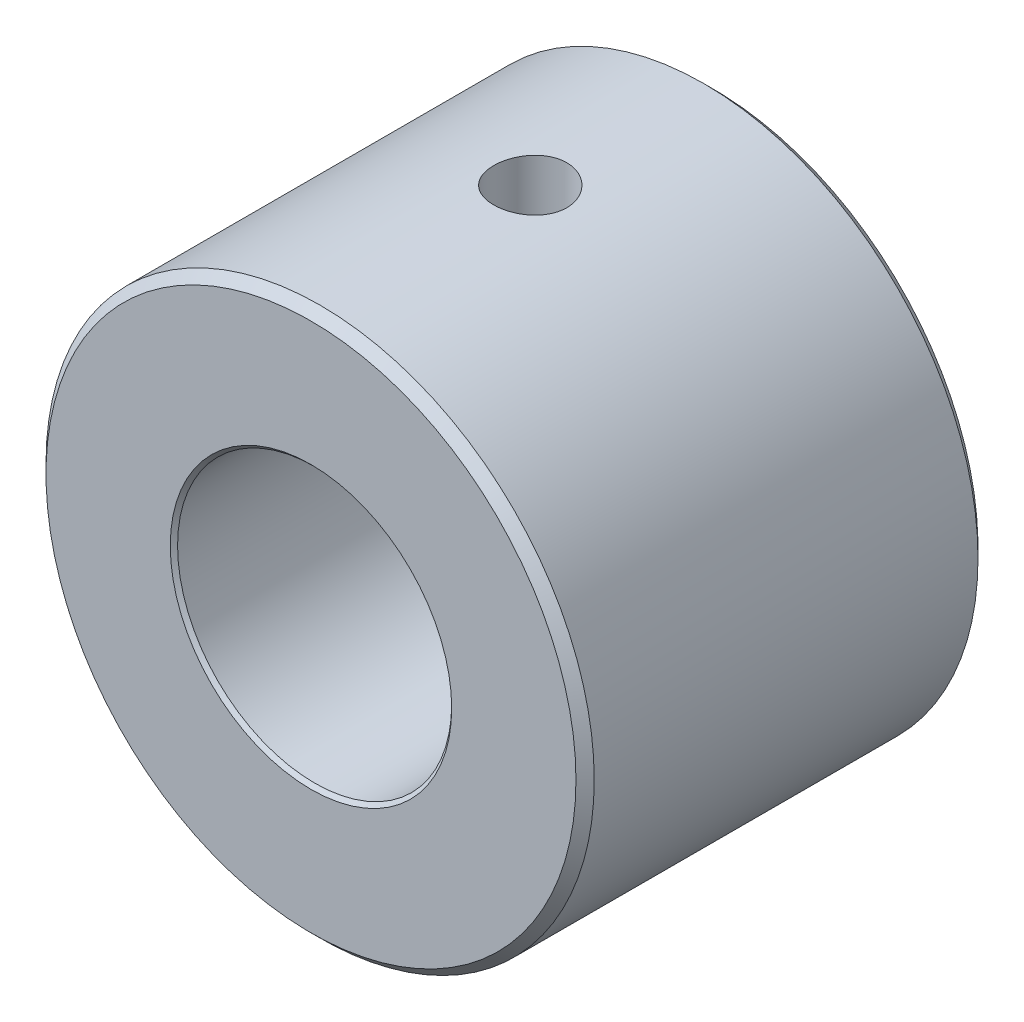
ISO-10303-21;
HEADER;
FILE_DESCRIPTION(('STEP AP214'),'2;1');
FILE_NAME('part.step','',(''),(''),'','','');
FILE_SCHEMA(('AUTOMOTIVE_DESIGN { 1 0 10303 214 1 1 1 1 }'));
ENDSEC;
DATA;
#1=APPLICATION_CONTEXT('core data for automotive mechanical design processes');
#2=APPLICATION_PROTOCOL_DEFINITION('international standard','automotive_design',2000,#1);
#3=PRODUCT_CONTEXT('',#1,'mechanical');
#4=PRODUCT('Part','Part','',(#3));
#5=PRODUCT_RELATED_PRODUCT_CATEGORY('part','',(#4));
#6=PRODUCT_DEFINITION_FORMATION('','',#4);
#7=PRODUCT_DEFINITION_CONTEXT('part definition',#1,'design');
#8=PRODUCT_DEFINITION('design','',#6,#7);
#9=PRODUCT_DEFINITION_SHAPE('','',#8);
#10=(LENGTH_UNIT() NAMED_UNIT(*) SI_UNIT(.MILLI.,.METRE.));
#11=(NAMED_UNIT(*) PLANE_ANGLE_UNIT() SI_UNIT($,.RADIAN.));
#12=(NAMED_UNIT(*) SI_UNIT($,.STERADIAN.) SOLID_ANGLE_UNIT());
#13=UNCERTAINTY_MEASURE_WITH_UNIT(LENGTH_MEASURE(1.E-05),#10,'distance_accuracy_value','');
#14=(GEOMETRIC_REPRESENTATION_CONTEXT(3) GLOBAL_UNCERTAINTY_ASSIGNED_CONTEXT((#13)) GLOBAL_UNIT_ASSIGNED_CONTEXT((#10,
#11,#12)) REPRESENTATION_CONTEXT('',''));
#15=CARTESIAN_POINT('',(0.,0.,0.));
#16=DIRECTION('',(0.,0.,1.));
#17=DIRECTION('',(1.,0.,0.));
#18=AXIS2_PLACEMENT_3D('',#15,#16,#17);
#19=CARTESIAN_POINT('',(0.,0.,0.));
#20=DIRECTION('',(0.,0.,-1.));
#21=DIRECTION('',(-1.,0.,0.));
#22=AXIS2_PLACEMENT_3D('',#19,#20,#21);
#23=CYLINDRICAL_SURFACE('',#22,15.);
#24=CARTESIAN_POINT('',(0.,15.,0.));
#25=CARTESIAN_POINT('',(0.111808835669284,14.9999983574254,-4.70970691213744E-06));
#26=CARTESIAN_POINT('',(0.22368597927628,14.9987367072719,-0.00940753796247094));
#27=CARTESIAN_POINT('',(0.444322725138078,14.993825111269,-0.0467663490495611));
#28=CARTESIAN_POINT('',(0.553079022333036,14.9901727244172,-0.0747412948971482));
#29=CARTESIAN_POINT('',(0.764248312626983,14.9808907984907,-0.148401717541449));
#30=CARTESIAN_POINT('',(0.866665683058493,14.9752626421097,-0.194074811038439));
#31=CARTESIAN_POINT('',(1.0623638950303,14.9626538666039,-0.301806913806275));
#32=CARTESIAN_POINT('',(1.15564620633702,14.9556734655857,-0.363863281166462));
#33=CARTESIAN_POINT('',(1.33102582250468,14.9410899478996,-0.503013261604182));
#34=CARTESIAN_POINT('',(1.41305798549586,14.9334835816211,-0.58018864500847));
#35=CARTESIAN_POINT('',(1.56304735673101,14.9185313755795,-0.747210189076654));
#36=CARTESIAN_POINT('',(1.63100381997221,14.9111855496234,-0.837057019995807));
#37=CARTESIAN_POINT('',(1.75115902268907,14.8975543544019,-1.02729912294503));
#38=CARTESIAN_POINT('',(1.80329607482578,14.8912731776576,-1.12773368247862));
#39=CARTESIAN_POINT('',(1.8899384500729,14.8805258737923,-1.33603106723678));
#40=CARTESIAN_POINT('',(1.92444453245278,14.8760596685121,-1.44389357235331));
#41=CARTESIAN_POINT('',(1.97464606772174,14.8694793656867,-1.66330581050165));
#42=CARTESIAN_POINT('',(1.99045204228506,14.8673514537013,-1.77482983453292));
#43=CARTESIAN_POINT('',(2.00314680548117,14.8656465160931,-1.99896617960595));
#44=CARTESIAN_POINT('',(2.00003645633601,14.866069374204,-2.11157845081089));
#45=CARTESIAN_POINT('',(1.97507745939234,14.8694055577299,-2.33392113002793));
#46=CARTESIAN_POINT('',(1.95335097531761,14.8723026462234,-2.4436655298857));
#47=CARTESIAN_POINT('',(1.89196724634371,14.8802355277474,-2.65793683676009));
#48=CARTESIAN_POINT('',(1.85230959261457,14.8852713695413,-2.76246362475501));
#49=CARTESIAN_POINT('',(1.75605929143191,14.8969326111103,-2.96370963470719));
#50=CARTESIAN_POINT('',(1.69941397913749,14.903562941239,-3.0604033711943));
#51=CARTESIAN_POINT('',(1.57083393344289,14.9176623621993,-3.24295908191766));
#52=CARTESIAN_POINT('',(1.49889840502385,14.9251314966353,-3.32882049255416));
#53=CARTESIAN_POINT('',(1.34110490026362,14.9401389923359,-3.48798301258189));
#54=CARTESIAN_POINT('',(1.25514170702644,14.947677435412,-3.56117984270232));
#55=CARTESIAN_POINT('',(1.07209417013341,14.9619192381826,-3.69212204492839));
#56=CARTESIAN_POINT('',(0.975009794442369,14.9686225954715,-3.74986737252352));
#57=CARTESIAN_POINT('',(0.772392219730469,14.9804439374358,-3.84826911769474));
#58=CARTESIAN_POINT('',(0.66685557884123,14.9855612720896,-3.88891853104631));
#59=CARTESIAN_POINT('',(0.45037092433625,14.9936282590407,-3.95188931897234));
#60=CARTESIAN_POINT('',(0.339423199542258,14.9965780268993,-3.97421167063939));
#61=CARTESIAN_POINT('',(0.116166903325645,14.9999624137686,-3.99975843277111));
#62=CARTESIAN_POINT('',(0.00387503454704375,15.0004159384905,-4.00312640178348));
#63=CARTESIAN_POINT('',(-0.219671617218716,14.9988079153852,-3.99104833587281));
#64=CARTESIAN_POINT('',(-0.330926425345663,14.996746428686,-3.97560275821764));
#65=CARTESIAN_POINT('',(-0.548813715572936,14.990351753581,-3.92645534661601));
#66=CARTESIAN_POINT('',(-0.655462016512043,14.9860271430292,-3.89282243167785));
#67=CARTESIAN_POINT('',(-0.861605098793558,14.9755900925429,-3.80832703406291));
#68=CARTESIAN_POINT('',(-0.961099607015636,14.9694775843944,-3.75746389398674));
#69=CARTESIAN_POINT('',(-1.15074887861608,14.9560983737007,-3.63960784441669));
#70=CARTESIAN_POINT('',(-1.2408458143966,14.9488251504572,-3.57252263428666));
#71=CARTESIAN_POINT('',(-1.40855294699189,14.9339572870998,-3.42425667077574));
#72=CARTESIAN_POINT('',(-1.48616257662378,14.9263626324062,-3.34307527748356));
#73=CARTESIAN_POINT('',(-1.62720549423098,14.9116490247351,-3.16828685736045));
#74=CARTESIAN_POINT('',(-1.69054327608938,14.904533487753,-3.07460243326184));
#75=CARTESIAN_POINT('',(-1.80058351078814,14.8916413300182,-2.87784058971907));
#76=CARTESIAN_POINT('',(-1.84728633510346,14.8858646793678,-2.77476338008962));
#77=CARTESIAN_POINT('',(-1.92257836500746,14.8763281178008,-2.56244275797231));
#78=CARTESIAN_POINT('',(-1.95122028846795,14.872562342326,-2.45321831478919));
#79=CARTESIAN_POINT('',(-1.98974667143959,14.8674574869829,-2.23145636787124));
#80=CARTESIAN_POINT('',(-1.99963213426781,14.8661182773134,-2.11891904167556));
#81=CARTESIAN_POINT('',(-2.00034485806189,14.8660223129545,-1.89467650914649));
#82=CARTESIAN_POINT('',(-1.99132219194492,14.8672452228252,-1.78297175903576));
#83=CARTESIAN_POINT('',(-1.95479376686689,14.872091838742,-1.56268212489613));
#84=CARTESIAN_POINT('',(-1.92728801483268,14.8757155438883,-1.45409723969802));
#85=CARTESIAN_POINT('',(-1.85462310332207,14.8849489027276,-1.24315631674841));
#86=CARTESIAN_POINT('',(-1.80947220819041,14.890557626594,-1.14079738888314));
#87=CARTESIAN_POINT('',(-1.70281342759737,14.9031304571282,-0.945084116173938));
#88=CARTESIAN_POINT('',(-1.64130522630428,14.910094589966,-0.851729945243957));
#89=CARTESIAN_POINT('',(-1.50312448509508,14.9246596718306,-0.675910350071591));
#90=CARTESIAN_POINT('',(-1.42634027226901,14.9322650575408,-0.593533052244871));
#91=CARTESIAN_POINT('',(-1.26002169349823,14.9472171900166,-0.442776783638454));
#92=CARTESIAN_POINT('',(-1.17048434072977,14.9545638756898,-0.37440110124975));
#93=CARTESIAN_POINT('',(-0.980752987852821,14.9682063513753,-0.253332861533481));
#94=CARTESIAN_POINT('',(-0.880514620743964,14.9744974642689,-0.200709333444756));
#95=CARTESIAN_POINT('',(-0.672592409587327,14.9852732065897,-0.113119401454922));
#96=CARTESIAN_POINT('',(-0.564916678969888,14.9897597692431,-0.0781340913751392));
#97=CARTESIAN_POINT('',(-0.380588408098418,14.9953572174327,-0.0350519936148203));
#98=CARTESIAN_POINT('',(-0.305091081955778,14.9970896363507,-0.0219267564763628));
#99=CARTESIAN_POINT('',(-0.153073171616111,14.9994115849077,-0.00439918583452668));
#100=CARTESIAN_POINT('',(-0.0765525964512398,15.000001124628,3.22461360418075E-06));
#101=CARTESIAN_POINT('',(0.,15.,0.));
#102=B_SPLINE_CURVE_WITH_KNOTS('',3,(#24,#25,#26,#27,#28,#29,#30,#31,#32,#33,#34,#35,#36,#37,
#38,#39,#40,#41,#42,#43,#44,#45,#46,#47,#48,#49,#50,#51,#52,#53,#54,#55,#56,#57,#58,#59,#60,#61,
#62,#63,#64,#65,#66,#67,#68,#69,#70,#71,#72,#73,#74,#75,#76,#77,#78,#79,#80,#81,#82,#83,#84,#85,
#86,#87,#88,#89,#90,#91,#92,#93,#94,#95,#96,#97,#98,#99,#100,#101),.UNSPECIFIED.,.T.,.F.,(4,2,2,
2,2,2,2,2,2,2,2,2,2,2,2,2,2,2,2,2,2,2,2,2,2,2,2,2,2,2,2,2,2,2,2,2,2,2,4),(0.,0.335146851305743,
0.670636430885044,1.0058916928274,1.34109292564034,1.67815978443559,2.01524447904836,
2.35362721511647,2.69199537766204,3.02835355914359,3.3646964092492,3.69884885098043,
4.0330089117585,4.36821583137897,4.70344018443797,5.04130544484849,5.37917167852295,
5.71717620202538,6.05516270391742,6.3905858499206,6.72600084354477,7.06015363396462,
7.39431917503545,7.73043274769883,8.0665615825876,8.40487704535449,8.74318495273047,
9.08050074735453,9.41779849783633,9.75242927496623,10.0870599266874,10.4215340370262,
10.756014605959,11.0930366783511,11.4301378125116,11.7686952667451,12.1068890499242,
12.3363573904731,12.5658237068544),.UNSPECIFIED.);
#103=CARTESIAN_POINT('',(0.,15.,0.));
#104=VERTEX_POINT('',#103);
#105=EDGE_CURVE('E126',#104,#104,#102,.T.);
#106=ORIENTED_EDGE('',*,*,#105,.F.);
#107=EDGE_LOOP('',(#106));
#108=FACE_BOUND('',#107,.T.);
#109=CARTESIAN_POINT('',(0.,0.,9.50000000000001));
#110=DIRECTION('',(0.,0.,1.));
#111=DIRECTION('',(1.,0.,0.));
#112=AXIS2_PLACEMENT_3D('',#109,#110,#111);
#113=CIRCLE('',#112,15.);
#114=CARTESIAN_POINT('',(15.,0.,9.50000000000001));
#115=VERTEX_POINT('',#114);
#116=EDGE_CURVE('E82',#115,#115,#113,.F.);
#117=ORIENTED_EDGE('',*,*,#116,.T.);
#118=EDGE_LOOP('',(#117));
#119=FACE_BOUND('',#118,.T.);
#120=CARTESIAN_POINT('',(0.,0.,-11.5));
#121=DIRECTION('',(0.,0.,-1.));
#122=DIRECTION('',(-1.,0.,0.));
#123=AXIS2_PLACEMENT_3D('',#120,#121,#122);
#124=CIRCLE('',#123,15.);
#125=CARTESIAN_POINT('',(8.99999999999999,-12.,-11.5));
#126=VERTEX_POINT('',#125);
#127=CARTESIAN_POINT('',(-8.99999999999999,-12.,-11.5));
#128=VERTEX_POINT('',#127);
#129=EDGE_CURVE('E80',#126,#128,#124,.F.);
#130=ORIENTED_EDGE('',*,*,#129,.T.);
#131=DIRECTION('',(0.,0.,-1.));
#132=VECTOR('',#131,1.);
#133=CARTESIAN_POINT('',(-8.99999999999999,-12.,0.));
#134=LINE('',#133,#132);
#135=CARTESIAN_POINT('',(-8.99999999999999,-12.,8.1));
#136=VERTEX_POINT('',#135);
#137=EDGE_CURVE('E50',#128,#136,#134,.F.);
#138=ORIENTED_EDGE('',*,*,#137,.T.);
#139=CARTESIAN_POINT('',(0.,0.,8.1));
#140=DIRECTION('',(0.,0.,1.));
#141=DIRECTION('',(1.,0.,0.));
#142=AXIS2_PLACEMENT_3D('',#139,#140,#141);
#143=CIRCLE('',#142,15.);
#144=CARTESIAN_POINT('',(8.99999999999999,-12.,8.1));
#145=VERTEX_POINT('',#144);
#146=EDGE_CURVE('E12',#145,#136,#143,.F.);
#147=ORIENTED_EDGE('',*,*,#146,.F.);
#148=DIRECTION('',(0.,0.,-1.));
#149=VECTOR('',#148,1.);
#150=CARTESIAN_POINT('',(8.99999999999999,-12.,0.));
#151=LINE('',#150,#149);
#152=EDGE_CURVE('E160',#145,#126,#151,.T.);
#153=ORIENTED_EDGE('',*,*,#152,.T.);
#154=EDGE_LOOP('',(#130,#138,#147,#153));
#155=FACE_BOUND('',#154,.T.);
#156=ADVANCED_FACE('F35',(#108,#119,#155),#23,.T.);
#157=CARTESIAN_POINT('',(0.,7.5,-12.));
#158=DIRECTION('',(0.,0.,-1.));
#159=DIRECTION('',(-1.,0.,0.));
#160=AXIS2_PLACEMENT_3D('',#157,#158,#159);
#161=PLANE('',#160);
#162=CARTESIAN_POINT('',(0.,0.,-12.));
#163=DIRECTION('',(0.,0.,-1.));
#164=DIRECTION('',(-1.,0.,0.));
#165=AXIS2_PLACEMENT_3D('',#162,#163,#164);
#166=CIRCLE('',#165,7.7);
#167=CARTESIAN_POINT('',(-7.7,0.,-12.));
#168=VERTEX_POINT('',#167);
#169=EDGE_CURVE('E88',#168,#168,#166,.F.);
#170=ORIENTED_EDGE('',*,*,#169,.T.);
#171=EDGE_LOOP('',(#170));
#172=FACE_BOUND('',#171,.T.);
#173=CARTESIAN_POINT('',(0.,0.,-12.));
#174=DIRECTION('',(0.,0.,-1.));
#175=DIRECTION('',(-1.,0.,0.));
#176=AXIS2_PLACEMENT_3D('',#173,#174,#175);
#177=CIRCLE('',#176,14.5);
#178=CARTESIAN_POINT('',(-8.13941029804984,-12.,-12.));
#179=VERTEX_POINT('',#178);
#180=CARTESIAN_POINT('',(8.13941029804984,-12.,-12.));
#181=VERTEX_POINT('',#180);
#182=EDGE_CURVE('E78',#179,#181,#177,.T.);
#183=ORIENTED_EDGE('',*,*,#182,.T.);
#184=DIRECTION('',(-1.,0.,0.));
#185=VECTOR('',#184,1.);
#186=CARTESIAN_POINT('',(-17.3129226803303,-12.,-12.));
#187=LINE('',#186,#185);
#188=EDGE_CURVE('E66',#181,#179,#187,.T.);
#189=ORIENTED_EDGE('',*,*,#188,.T.);
#190=EDGE_LOOP('',(#183,#189));
#191=FACE_BOUND('',#190,.T.);
#192=ADVANCED_FACE('F81',(#172,#191),#161,.T.);
#193=CARTESIAN_POINT('',(0.,0.,-12.));
#194=DIRECTION('',(0.,0.,1.));
#195=DIRECTION('',(1.,0.,0.));
#196=AXIS2_PLACEMENT_3D('',#193,#194,#195);
#197=CONICAL_SURFACE('',#196,14.5,0.785398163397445);
#198=ORIENTED_EDGE('',*,*,#129,.F.);
#199=CARTESIAN_POINT('',(30.7437505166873,-12.,6.502699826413));
#200=CARTESIAN_POINT('',(30.2743314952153,-12.,6.06542404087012));
#201=CARTESIAN_POINT('',(29.8042635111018,-12.,5.62884326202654));
#202=CARTESIAN_POINT('',(28.8626219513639,-12.,4.75730230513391));
#203=CARTESIAN_POINT('',(28.3910483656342,-12.,4.32234213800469));
#204=CARTESIAN_POINT('',(27.4460881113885,-12.,3.45418137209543));
#205=CARTESIAN_POINT('',(26.9727010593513,-12.,3.02098119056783));
#206=CARTESIAN_POINT('',(26.0239654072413,-12.,2.15673496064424));
#207=CARTESIAN_POINT('',(25.5486168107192,-12.,1.7256889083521));
#208=CARTESIAN_POINT('',(24.5924854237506,-12.,0.863250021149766));
#209=CARTESIAN_POINT('',(24.1116875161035,-12.,0.431873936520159));
#210=CARTESIAN_POINT('',(23.1474197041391,-12.,-0.427881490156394));
#211=CARTESIAN_POINT('',(22.6639498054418,-12.,-0.85626083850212));
#212=CARTESIAN_POINT('',(21.6939335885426,-12.,-1.70940741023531));
#213=CARTESIAN_POINT('',(21.2073876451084,-12.,-2.13417505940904));
#214=CARTESIAN_POINT('',(20.230594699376,-12.,-2.97943459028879));
#215=CARTESIAN_POINT('',(19.7403477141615,-12.,-3.39992649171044));
#216=CARTESIAN_POINT('',(18.8540514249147,-12.,-4.15202732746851));
#217=CARTESIAN_POINT('',(18.4587978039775,-12.,-4.48457345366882));
#218=CARTESIAN_POINT('',(17.6650184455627,-12.,-5.14573551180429));
#219=CARTESIAN_POINT('',(17.266492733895,-12.,-5.47435147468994));
#220=CARTESIAN_POINT('',(16.4655068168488,-12.,-6.12700369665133));
#221=CARTESIAN_POINT('',(16.0630454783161,-12.,-6.45103856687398));
#222=CARTESIAN_POINT('',(15.2536497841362,-12.,-7.09347509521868));
#223=CARTESIAN_POINT('',(14.8467154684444,-12.,-7.41187680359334));
#224=CARTESIAN_POINT('',(14.0281921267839,-12.,-8.0413485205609));
#225=CARTESIAN_POINT('',(13.6166111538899,-12.,-8.35242897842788));
#226=CARTESIAN_POINT('',(12.7871887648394,-12.,-8.96619422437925));
#227=CARTESIAN_POINT('',(12.3693470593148,-12.,-9.26887862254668));
#228=CARTESIAN_POINT('',(11.5264381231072,-12.,-9.86360671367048));
#229=CARTESIAN_POINT('',(11.1013745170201,-12.,-10.1556555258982));
#230=CARTESIAN_POINT('',(10.2424445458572,-12.,-10.7264583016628));
#231=CARTESIAN_POINT('',(9.80857934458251,-12.,-11.0052140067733));
#232=CARTESIAN_POINT('',(8.9703155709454,-12.,-11.5210941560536));
#233=CARTESIAN_POINT('',(8.56683183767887,-12.,-11.7596980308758));
#234=CARTESIAN_POINT('',(7.74971969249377,-12.,-12.2191053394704));
#235=CARTESIAN_POINT('',(7.33609018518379,-12.,-12.4399068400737));
#236=CARTESIAN_POINT('',(6.49753492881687,-12.,-12.8586638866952));
#237=CARTESIAN_POINT('',(6.07261386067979,-12.,-13.0566287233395));
#238=CARTESIAN_POINT('',(5.21032692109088,-12.,-13.4234777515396));
#239=CARTESIAN_POINT('',(4.7729642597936,-12.,-13.592369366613));
#240=CARTESIAN_POINT('',(3.97857447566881,-12.,-13.8619509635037));
#241=CARTESIAN_POINT('',(3.62389496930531,-12.,-13.9695169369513));
#242=CARTESIAN_POINT('',(2.90738987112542,-12.,-14.1576528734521));
#243=CARTESIAN_POINT('',(2.54556514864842,-12.,-14.2382260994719));
#244=CARTESIAN_POINT('',(1.81757852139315,-12.,-14.3683932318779));
#245=CARTESIAN_POINT('',(1.4514356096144,-12.,-14.4180918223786));
#246=CARTESIAN_POINT('',(0.716130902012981,-12.,-14.4842247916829));
#247=CARTESIAN_POINT('',(0.346969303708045,-12.,-14.5006613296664));
#248=CARTESIAN_POINT('',(-0.392521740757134,-12.,-14.4992954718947));
#249=CARTESIAN_POINT('',(-0.762850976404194,-12.,-14.4813787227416));
#250=CARTESIAN_POINT('',(-1.50034873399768,-12.,-14.4121476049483));
#251=CARTESIAN_POINT('',(-1.86751701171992,-12.,-14.3608306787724));
#252=CARTESIAN_POINT('',(-2.59732659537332,-12.,-14.2273929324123));
#253=CARTESIAN_POINT('',(-2.95994994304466,-12.,-14.1451753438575));
#254=CARTESIAN_POINT('',(-3.67793643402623,-12.,-13.9537898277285));
#255=CARTESIAN_POINT('',(-4.03329915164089,-12.,-13.8446203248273));
#256=CARTESIAN_POINT('',(-4.76833494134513,-12.,-13.5923627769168));
#257=CARTESIAN_POINT('',(-5.14724878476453,-12.,-13.4470822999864));
#258=CARTESIAN_POINT('',(-5.89581779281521,-12.,-13.1341872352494));
#259=CARTESIAN_POINT('',(-6.26546906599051,-12.,-12.9665634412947));
#260=CARTESIAN_POINT('',(-6.99656452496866,-12.,-12.6129782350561));
#261=CARTESIAN_POINT('',(-7.35799448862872,-12.,-12.4269876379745));
#262=CARTESIAN_POINT('',(-8.07284170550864,-12.,-12.0403870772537));
#263=CARTESIAN_POINT('',(-8.42625993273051,-12.,-11.8397789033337));
#264=CARTESIAN_POINT('',(-9.13057669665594,-12.,-11.4240058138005));
#265=CARTESIAN_POINT('',(-9.48138343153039,-12.,-11.2086861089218));
#266=CARTESIAN_POINT('',(-10.1766826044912,-12.,-10.7681038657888));
#267=CARTESIAN_POINT('',(-10.5211749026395,-12.,-10.5428411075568));
#268=CARTESIAN_POINT('',(-11.2043341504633,-12.,-10.0843656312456));
#269=CARTESIAN_POINT('',(-11.5430063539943,-12.,-9.8511607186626));
#270=CARTESIAN_POINT('',(-12.2155761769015,-12.,-9.37799025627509));
#271=CARTESIAN_POINT('',(-12.5494738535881,-12.,-9.13802478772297));
#272=CARTESIAN_POINT('',(-13.2908932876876,-12.,-8.59553591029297));
#273=CARTESIAN_POINT('',(-13.6973301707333,-12.,-8.29153156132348));
#274=CARTESIAN_POINT('',(-14.5048836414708,-12.,-7.67652460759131));
#275=CARTESIAN_POINT('',(-14.9060000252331,-12.,-7.36552173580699));
#276=CARTESIAN_POINT('',(-15.7037621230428,-12.,-6.73772340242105));
#277=CARTESIAN_POINT('',(-16.1004071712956,-12.,-6.42092709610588));
#278=CARTESIAN_POINT('',(-16.8898244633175,-12.,-5.78256100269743));
#279=CARTESIAN_POINT('',(-17.2825967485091,-12.,-5.46099126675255));
#280=CARTESIAN_POINT('',(-18.0652259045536,-12.,-4.81350620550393));
#281=CARTESIAN_POINT('',(-18.4550793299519,-12.,-4.48758671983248));
#282=CARTESIAN_POINT('',(-19.2319108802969,-12.,-3.83233683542));
#283=CARTESIAN_POINT('',(-19.6188889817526,-12.,-3.50300640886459));
#284=CARTESIAN_POINT('',(-20.7761100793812,-12.,-2.51065518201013));
#285=CARTESIAN_POINT('',(-21.542626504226,-12.,-1.84328555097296));
#286=CARTESIAN_POINT('',(-22.6624106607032,-12.,-0.857134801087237));
#287=CARTESIAN_POINT('',(-23.0186578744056,-12.,-0.541719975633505));
#288=CARTESIAN_POINT('',(-23.7296509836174,-12.,0.0907863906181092));
#289=CARTESIAN_POINT('',(-24.0843969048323,-12.,0.407877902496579));
#290=CARTESIAN_POINT('',(-25.1466639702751,-12.,1.36139124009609));
#291=CARTESIAN_POINT('',(-25.8521927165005,-12.,2.00003271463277));
#292=CARTESIAN_POINT('',(-27.2573846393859,-12.,3.28055758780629));
#293=CARTESIAN_POINT('',(-27.9570574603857,-12.,3.92243041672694));
#294=CARTESIAN_POINT('',(-29.0039346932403,-12.,4.88805690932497));
#295=CARTESIAN_POINT('',(-29.3524469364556,-12.,5.21039433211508));
#296=CARTESIAN_POINT('',(-30.0486759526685,-12.,5.85592599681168));
#297=CARTESIAN_POINT('',(-30.3963927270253,-12.,6.1791202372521));
#298=CARTESIAN_POINT('',(-30.7437505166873,-12.,6.502699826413));
#299=B_SPLINE_CURVE_WITH_KNOTS('',3,(#199,#200,#201,#202,#203,#204,#205,#206,#207,#208,#209,
#210,#211,#212,#213,#214,#215,#216,#217,#218,#219,#220,#221,#222,#223,#224,#225,#226,#227,#228,
#229,#230,#231,#232,#233,#234,#235,#236,#237,#238,#239,#240,#241,#242,#243,#244,#245,#246,#247,
#248,#249,#250,#251,#252,#253,#254,#255,#256,#257,#258,#259,#260,#261,#262,#263,#264,#265,#266,
#267,#268,#269,#270,#271,#272,#273,#274,#275,#276,#277,#278,#279,#280,#281,#282,#283,#284,#285,
#286,#287,#288,#289,#290,#291,#292,#293,#294,#295,#296,#297,#298),.UNSPECIFIED.,.F.,.F.,(4,2,2,
2,2,2,2,2,2,2,2,2,2,2,2,2,2,2,2,2,2,2,2,2,2,2,2,2,2,2,2,2,2,2,2,2,2,2,2,2,2,2,2,2,2,2,2,2,2,4),
(0.,1.92459937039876,3.84921168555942,5.77425637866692,7.69929758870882,9.63713833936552,
11.5749750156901,13.5125799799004,15.4501760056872,16.9997715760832,18.5493549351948,
20.0993984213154,21.6494280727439,23.1970917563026,24.7448271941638,26.2918075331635,
27.8385846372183,29.2444968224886,30.6505614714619,32.0560520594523,33.4611832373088,
34.572185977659,35.6830543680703,36.7901353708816,37.8971445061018,39.0078449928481,
40.1186305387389,41.2329239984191,42.3472826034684,43.5638355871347,44.7808913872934,
45.9999131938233,47.2187859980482,48.4534330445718,49.6881074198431,50.9216015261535,
52.1550808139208,53.6776414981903,55.2002603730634,56.7231030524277,58.2459294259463,
59.7703348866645,61.2947527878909,64.3436407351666,65.7710791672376,67.1984930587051,
70.0534076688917,72.9018790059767,74.3260476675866,75.7502138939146),.UNSPECIFIED.);
#300=EDGE_CURVE('E43',#126,#181,#299,.T.);
#301=ORIENTED_EDGE('',*,*,#300,.T.);
#302=ORIENTED_EDGE('',*,*,#182,.F.);
#303=EDGE_CURVE('E68',#179,#128,#299,.T.);
#304=ORIENTED_EDGE('',*,*,#303,.T.);
#305=EDGE_LOOP('',(#198,#301,#302,#304));
#306=FACE_BOUND('',#305,.T.);
#307=ADVANCED_FACE('F77',(#306),#197,.T.);
#308=CARTESIAN_POINT('',(0.,7.5,10.));
#309=DIRECTION('',(0.,0.,1.));
#310=DIRECTION('',(1.,0.,0.));
#311=AXIS2_PLACEMENT_3D('',#308,#309,#310);
#312=PLANE('',#311);
#313=CARTESIAN_POINT('',(0.,0.,10.));
#314=DIRECTION('',(0.,0.,1.));
#315=DIRECTION('',(1.,0.,0.));
#316=AXIS2_PLACEMENT_3D('',#313,#314,#315);
#317=CIRCLE('',#316,14.5);
#318=CARTESIAN_POINT('',(14.5,0.,10.));
#319=VERTEX_POINT('',#318);
#320=EDGE_CURVE('E93',#319,#319,#317,.T.);
#321=ORIENTED_EDGE('',*,*,#320,.T.);
#322=EDGE_LOOP('',(#321));
#323=FACE_BOUND('',#322,.T.);
#324=CARTESIAN_POINT('',(0.,0.,10.));
#325=DIRECTION('',(0.,0.,1.));
#326=DIRECTION('',(1.,0.,0.));
#327=AXIS2_PLACEMENT_3D('',#324,#325,#326);
#328=CIRCLE('',#327,7.70000000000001);
#329=CARTESIAN_POINT('',(7.70000000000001,0.,10.));
#330=VERTEX_POINT('',#329);
#331=EDGE_CURVE('E83',#330,#330,#328,.F.);
#332=ORIENTED_EDGE('',*,*,#331,.T.);
#333=EDGE_LOOP('',(#332));
#334=FACE_BOUND('',#333,.T.);
#335=ADVANCED_FACE('F116',(#323,#334),#312,.T.);
#336=CARTESIAN_POINT('',(0.,0.,0.));
#337=DIRECTION('',(0.,0.,-1.));
#338=DIRECTION('',(-1.,0.,0.));
#339=AXIS2_PLACEMENT_3D('',#336,#337,#338);
#340=CYLINDRICAL_SURFACE('',#339,7.5);
#341=CARTESIAN_POINT('',(0.,7.5,0.));
#342=CARTESIAN_POINT('',(-0.110254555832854,7.49999833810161,-2.61693485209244E-06));
#343=CARTESIAN_POINT('',(-0.22053716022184,7.49754486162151,-0.00914761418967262));
#344=CARTESIAN_POINT('',(-0.437925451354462,7.48799573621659,-0.0454212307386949));
#345=CARTESIAN_POINT('',(-0.545029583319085,7.48089785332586,-0.0725585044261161));
#346=CARTESIAN_POINT('',(-0.752891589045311,7.4628433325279,-0.143871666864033));
#347=CARTESIAN_POINT('',(-0.853657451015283,7.45189167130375,-0.188025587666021));
#348=CARTESIAN_POINT('',(-1.04635368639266,7.42728699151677,-0.292037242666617));
#349=CARTESIAN_POINT('',(-1.13828347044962,7.4136337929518,-0.351896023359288));
#350=CARTESIAN_POINT('',(-1.31282950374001,7.38474614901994,-0.487083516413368));
#351=CARTESIAN_POINT('',(-1.39521168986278,7.36948467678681,-0.562708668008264));
#352=CARTESIAN_POINT('',(-1.54628713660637,7.33927409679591,-0.726648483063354));
#353=CARTESIAN_POINT('',(-1.61497863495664,7.32432502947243,-0.814964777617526));
#354=CARTESIAN_POINT('',(-1.73786409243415,7.29615537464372,-1.00364823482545));
#355=CARTESIAN_POINT('',(-1.79178877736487,7.28296888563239,-1.10419632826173));
#356=CARTESIAN_POINT('',(-1.88187548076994,7.26021477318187,-1.31334011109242));
#357=CARTESIAN_POINT('',(-1.91804077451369,7.25064648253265,-1.42193431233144));
#358=CARTESIAN_POINT('',(-1.97076920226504,7.23649115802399,-1.64149553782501));
#359=CARTESIAN_POINT('',(-1.98775670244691,7.2317964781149,-1.75235353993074));
#360=CARTESIAN_POINT('',(-2.00297034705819,7.2275983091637,-1.97543768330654));
#361=CARTESIAN_POINT('',(-2.00119999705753,7.22809385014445,-2.08766356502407));
#362=CARTESIAN_POINT('',(-1.97928510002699,7.2341237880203,-2.30698541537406));
#363=CARTESIAN_POINT('',(-1.95965406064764,7.23951735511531,-2.41413718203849));
#364=CARTESIAN_POINT('',(-1.90339748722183,7.25451013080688,-2.62356833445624));
#365=CARTESIAN_POINT('',(-1.86677059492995,7.26410967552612,-2.72584733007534));
#366=CARTESIAN_POINT('',(-1.77714356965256,7.28655661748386,-2.92396814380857));
#367=CARTESIAN_POINT('',(-1.72396341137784,7.29943942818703,-3.01972433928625));
#368=CARTESIAN_POINT('',(-1.60286503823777,7.32698229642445,-3.20113415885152));
#369=CARTESIAN_POINT('',(-1.53494392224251,7.34164270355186,-3.28678578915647));
#370=CARTESIAN_POINT('',(-1.38366607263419,7.37167510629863,-3.4484889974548));
#371=CARTESIAN_POINT('',(-1.29987812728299,7.38705471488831,-3.52413631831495));
#372=CARTESIAN_POINT('',(-1.12061766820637,7.41636381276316,-3.66038878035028));
#373=CARTESIAN_POINT('',(-1.02514469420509,7.43029324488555,-3.72099332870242));
#374=CARTESIAN_POINT('',(-0.82459825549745,7.45521820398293,-3.82561790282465));
#375=CARTESIAN_POINT('',(-0.719484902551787,7.4662007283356,-3.86956477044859));
#376=CARTESIAN_POINT('',(-0.503002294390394,7.48390044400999,-3.93904718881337));
#377=CARTESIAN_POINT('',(-0.391634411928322,7.49061856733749,-3.96458676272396));
#378=CARTESIAN_POINT('',(-0.169254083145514,7.49889158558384,-3.99589487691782));
#379=CARTESIAN_POINT('',(-0.0583242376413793,7.50058997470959,-4.00221303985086));
#380=CARTESIAN_POINT('',(0.163010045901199,7.49904471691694,-3.99641683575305));
#381=CARTESIAN_POINT('',(0.273414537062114,7.49580158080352,-3.98430437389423));
#382=CARTESIAN_POINT('',(0.488602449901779,7.48483035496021,-3.94244155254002));
#383=CARTESIAN_POINT('',(0.593449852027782,7.47718026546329,-3.91299775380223));
#384=CARTESIAN_POINT('',(0.796706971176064,7.45826294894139,-3.83766405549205));
#385=CARTESIAN_POINT('',(0.895115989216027,7.44699532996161,-3.79177237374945));
#386=CARTESIAN_POINT('',(1.08483847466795,7.42175660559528,-3.68382611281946));
#387=CARTESIAN_POINT('',(1.17597518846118,7.40773686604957,-3.62147253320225));
#388=CARTESIAN_POINT('',(1.34668463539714,7.37861452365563,-3.482748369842));
#389=CARTESIAN_POINT('',(1.42625507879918,7.3635117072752,-3.40637501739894));
#390=CARTESIAN_POINT('',(1.57388924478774,7.33339745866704,-3.23921442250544));
#391=CARTESIAN_POINT('',(1.64156519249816,7.31840061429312,-3.14808143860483));
#392=CARTESIAN_POINT('',(1.76067191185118,7.29066447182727,-2.95543530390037));
#393=CARTESIAN_POINT('',(1.81210336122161,7.27792507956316,-2.85392258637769));
#394=CARTESIAN_POINT('',(1.89687411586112,7.2562926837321,-2.64390469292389));
#395=CARTESIAN_POINT('',(1.93031812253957,7.24737748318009,-2.53544418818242));
#396=CARTESIAN_POINT('',(1.97841205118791,7.234398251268,-2.31416068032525));
#397=CARTESIAN_POINT('',(1.99306677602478,7.23033298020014,-2.20133879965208));
#398=CARTESIAN_POINT('',(2.00288989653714,7.22761744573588,-1.9785052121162));
#399=CARTESIAN_POINT('',(1.99868155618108,7.22879397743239,-1.86852267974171));
#400=CARTESIAN_POINT('',(1.97234376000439,7.23602396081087,-1.65089648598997));
#401=CARTESIAN_POINT('',(1.95021476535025,7.24207728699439,-1.54325276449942));
#402=CARTESIAN_POINT('',(1.88902515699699,7.25827571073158,-1.33414424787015));
#403=CARTESIAN_POINT('',(1.8500966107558,7.26838885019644,-1.23263815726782));
#404=CARTESIAN_POINT('',(1.75651554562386,7.29156818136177,-1.03752116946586));
#405=CARTESIAN_POINT('',(1.70186056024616,7.30463483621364,-0.943911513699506));
#406=CARTESIAN_POINT('',(1.57648909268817,7.3327292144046,-0.764269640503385));
#407=CARTESIAN_POINT('',(1.50534729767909,7.3478033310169,-0.678541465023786));
#408=CARTESIAN_POINT('',(1.349830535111,7.37795503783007,-0.520037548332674));
#409=CARTESIAN_POINT('',(1.26545235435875,7.39303262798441,-0.447264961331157));
#410=CARTESIAN_POINT('',(1.08367998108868,7.42187812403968,-0.315207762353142));
#411=CARTESIAN_POINT('',(0.986045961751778,7.4356111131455,-0.256244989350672));
#412=CARTESIAN_POINT('',(0.781888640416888,7.45983810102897,-0.155662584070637));
#413=CARTESIAN_POINT('',(0.675371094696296,7.47033417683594,-0.1140318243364));
#414=CARTESIAN_POINT('',(0.47437470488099,7.48554752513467,-0.0547247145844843));
#415=CARTESIAN_POINT('',(0.380762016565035,7.49092770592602,-0.0342506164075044));
#416=CARTESIAN_POINT('',(0.191439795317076,7.49815449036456,-0.00688779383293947));
#417=CARTESIAN_POINT('',(0.0957304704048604,7.5000014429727,2.27220002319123E-06));
#418=CARTESIAN_POINT('',(0.,7.5,0.));
#419=B_SPLINE_CURVE_WITH_KNOTS('',3,(#341,#342,#343,#344,#345,#346,#347,#348,#349,#350,#351,
#352,#353,#354,#355,#356,#357,#358,#359,#360,#361,#362,#363,#364,#365,#366,#367,#368,#369,#370,
#371,#372,#373,#374,#375,#376,#377,#378,#379,#380,#381,#382,#383,#384,#385,#386,#387,#388,#389,
#390,#391,#392,#393,#394,#395,#396,#397,#398,#399,#400,#401,#402,#403,#404,#405,#406,#407,#408,
#409,#410,#411,#412,#413,#414,#415,#416,#417,#418),.UNSPECIFIED.,.T.,.F.,(4,2,2,2,2,2,2,2,2,2,2,
2,2,2,2,2,2,2,2,2,2,2,2,2,2,2,2,2,2,2,2,2,2,2,2,2,2,2,4),(0.,0.330412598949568,
0.660984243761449,0.991130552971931,1.32129886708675,1.65834897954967,1.99544244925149,
2.33832582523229,2.68114594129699,3.01622158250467,3.35123460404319,3.67691002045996,
4.00261146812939,4.33198673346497,4.66142688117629,5.00161259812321,5.34181171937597,
5.68348809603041,6.02508977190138,6.35682717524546,6.6885302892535,7.01453535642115,
7.34057575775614,7.67300286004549,8.00549568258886,8.34736496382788,8.68921998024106,
9.02906297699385,9.36881908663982,9.6974334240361,10.0260393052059,10.352107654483,
10.67822717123,11.0139433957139,11.3497412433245,11.692722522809,12.0354832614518,
12.3223981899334,12.6092847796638),.UNSPECIFIED.);
#420=CARTESIAN_POINT('',(0.,7.5,0.));
#421=VERTEX_POINT('',#420);
#422=EDGE_CURVE('E135',#421,#421,#419,.T.);
#423=ORIENTED_EDGE('',*,*,#422,.F.);
#424=EDGE_LOOP('',(#423));
#425=FACE_BOUND('',#424,.T.);
#426=CARTESIAN_POINT('',(0.,0.,-11.8));
#427=DIRECTION('',(0.,0.,-1.));
#428=DIRECTION('',(-1.,0.,0.));
#429=AXIS2_PLACEMENT_3D('',#426,#427,#428);
#430=CIRCLE('',#429,7.5);
#431=CARTESIAN_POINT('',(-7.5,0.,-11.8));
#432=VERTEX_POINT('',#431);
#433=EDGE_CURVE('E165',#432,#432,#430,.T.);
#434=ORIENTED_EDGE('',*,*,#433,.T.);
#435=EDGE_LOOP('',(#434));
#436=FACE_BOUND('',#435,.T.);
#437=CARTESIAN_POINT('',(0.,0.,9.79999999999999));
#438=DIRECTION('',(0.,0.,1.));
#439=DIRECTION('',(1.,0.,0.));
#440=AXIS2_PLACEMENT_3D('',#437,#438,#439);
#441=CIRCLE('',#440,7.5);
#442=CARTESIAN_POINT('',(7.5,0.,9.79999999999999));
#443=VERTEX_POINT('',#442);
#444=EDGE_CURVE('E162',#443,#443,#441,.T.);
#445=ORIENTED_EDGE('',*,*,#444,.T.);
#446=EDGE_LOOP('',(#445));
#447=FACE_BOUND('',#446,.T.);
#448=CARTESIAN_POINT('',(0.,-7.5,-3.65));
#449=CARTESIAN_POINT('',(-0.0914999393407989,-7.49999831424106,-3.64999689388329));
#450=CARTESIAN_POINT('',(-0.18303729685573,-7.49830854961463,-3.64236318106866));
#451=CARTESIAN_POINT('',(-0.363511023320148,-7.49173097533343,-3.61206225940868));
#452=CARTESIAN_POINT('',(-0.452445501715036,-7.48684089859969,-3.58938439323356));
#453=CARTESIAN_POINT('',(-0.625079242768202,-7.47440705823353,-3.52974055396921));
#454=CARTESIAN_POINT('',(-0.708783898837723,-7.46686608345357,-3.4927895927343));
#455=CARTESIAN_POINT('',(-0.868802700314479,-7.4499439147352,-3.40569630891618));
#456=CARTESIAN_POINT('',(-0.945117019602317,-7.44056276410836,-3.35555429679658));
#457=CARTESIAN_POINT('',(-1.08942970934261,-7.42081741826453,-3.24264148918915));
#458=CARTESIAN_POINT('',(-1.15729102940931,-7.41044091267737,-3.17969766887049));
#459=CARTESIAN_POINT('',(-1.28158292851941,-7.38996090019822,-3.04333940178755));
#460=CARTESIAN_POINT('',(-1.33801247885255,-7.37985741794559,-2.96992401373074));
#461=CARTESIAN_POINT('',(-1.43844520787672,-7.36094592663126,-2.81369134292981));
#462=CARTESIAN_POINT('',(-1.48230220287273,-7.35215368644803,-2.7307780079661));
#463=CARTESIAN_POINT('',(-1.55540709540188,-7.33703697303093,-2.5585327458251));
#464=CARTESIAN_POINT('',(-1.58465676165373,-7.33071220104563,-2.46920159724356));
#465=CARTESIAN_POINT('',(-1.62726320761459,-7.3213719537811,-2.28814395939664));
#466=CARTESIAN_POINT('',(-1.64086278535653,-7.31830597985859,-2.19647726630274));
#467=CARTESIAN_POINT('',(-1.65253801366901,-7.31567882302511,-2.01211606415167));
#468=CARTESIAN_POINT('',(-1.65061559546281,-7.31611720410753,-1.91942168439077));
#469=CARTESIAN_POINT('',(-1.6314967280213,-7.32040352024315,-1.73744348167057));
#470=CARTESIAN_POINT('',(-1.61458260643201,-7.32418842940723,-1.64812828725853));
#471=CARTESIAN_POINT('',(-1.5664078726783,-7.33464165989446,-1.47363508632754));
#472=CARTESIAN_POINT('',(-1.53514644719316,-7.34131014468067,-1.38845731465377));
#473=CARTESIAN_POINT('',(-1.45890598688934,-7.35684109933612,-1.22386456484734));
#474=CARTESIAN_POINT('',(-1.41381862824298,-7.36572078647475,-1.14450145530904));
#475=CARTESIAN_POINT('',(-1.3112823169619,-7.38466310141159,-0.994363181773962));
#476=CARTESIAN_POINT('',(-1.25383166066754,-7.39472589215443,-0.923589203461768));
#477=CARTESIAN_POINT('',(-1.12670629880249,-7.41517081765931,-0.791013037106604));
#478=CARTESIAN_POINT('',(-1.05679158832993,-7.42555512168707,-0.729441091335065));
#479=CARTESIAN_POINT('',(-0.907510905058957,-7.44527255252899,-0.618858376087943));
#480=CARTESIAN_POINT('',(-0.828144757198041,-7.45460565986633,-0.569847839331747));
#481=CARTESIAN_POINT('',(-0.66193126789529,-7.47119996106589,-0.485721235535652));
#482=CARTESIAN_POINT('',(-0.575068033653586,-7.47845660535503,-0.45063561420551));
#483=CARTESIAN_POINT('',(-0.396483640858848,-7.49004657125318,-0.395622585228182));
#484=CARTESIAN_POINT('',(-0.304763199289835,-7.49438032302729,-0.375692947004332));
#485=CARTESIAN_POINT('',(-0.121042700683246,-7.49957488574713,-0.351893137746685));
#486=CARTESIAN_POINT('',(-0.0290852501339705,-7.50050369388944,-0.347708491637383));
#487=CARTESIAN_POINT('',(0.154214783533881,-7.49897438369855,-0.354664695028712));
#488=CARTESIAN_POINT('',(0.245557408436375,-7.49651649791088,-0.365804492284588));
#489=CARTESIAN_POINT('',(0.423991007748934,-7.48853291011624,-0.402832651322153));
#490=CARTESIAN_POINT('',(0.511117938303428,-7.48304158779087,-0.428555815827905));
#491=CARTESIAN_POINT('',(0.679820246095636,-7.46960587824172,-0.493836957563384));
#492=CARTESIAN_POINT('',(0.761395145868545,-7.46166128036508,-0.533396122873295));
#493=CARTESIAN_POINT('',(0.917976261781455,-7.44403270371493,-0.62587978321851));
#494=CARTESIAN_POINT('',(0.992870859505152,-7.43432530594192,-0.678988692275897));
#495=CARTESIAN_POINT('',(1.13279771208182,-7.41429527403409,-0.796821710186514));
#496=CARTESIAN_POINT('',(1.19782866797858,-7.40397255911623,-0.86154734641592));
#497=CARTESIAN_POINT('',(1.31742759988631,-7.38364007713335,-1.00222027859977));
#498=CARTESIAN_POINT('',(1.37177769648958,-7.373639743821,-1.07835443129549));
#499=CARTESIAN_POINT('',(1.46692164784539,-7.35530407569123,-1.23885442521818));
#500=CARTESIAN_POINT('',(1.50771609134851,-7.34696866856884,-1.32321990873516));
#501=CARTESIAN_POINT('',(1.57431369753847,-7.33298679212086,-1.49733416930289));
#502=CARTESIAN_POINT('',(1.60020149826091,-7.32732517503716,-1.58704929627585));
#503=CARTESIAN_POINT('',(1.63649815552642,-7.31930499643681,-1.76969698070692));
#504=CARTESIAN_POINT('',(1.64690952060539,-7.31694589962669,-1.8626290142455));
#505=CARTESIAN_POINT('',(1.6518500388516,-7.31583187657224,-2.04687496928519));
#506=CARTESIAN_POINT('',(1.64672474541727,-7.3169985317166,-2.13817931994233));
#507=CARTESIAN_POINT('',(1.62151064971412,-7.32262705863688,-2.31858911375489));
#508=CARTESIAN_POINT('',(1.60142202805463,-7.32708889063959,-2.40769458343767));
#509=CARTESIAN_POINT('',(1.54701934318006,-7.33876659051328,-2.58089887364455));
#510=CARTESIAN_POINT('',(1.5127561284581,-7.34597260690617,-2.66501437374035));
#511=CARTESIAN_POINT('',(1.4310203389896,-7.36233049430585,-2.82635416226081));
#512=CARTESIAN_POINT('',(1.38354636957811,-7.37148257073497,-2.90357772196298));
#513=CARTESIAN_POINT('',(1.27559296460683,-7.39093521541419,-3.05064370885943));
#514=CARTESIAN_POINT('',(1.21486750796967,-7.40125543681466,-3.12030297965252));
#515=CARTESIAN_POINT('',(1.08263275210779,-7.42175007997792,-3.2485559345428));
#516=CARTESIAN_POINT('',(1.01112096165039,-7.43192446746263,-3.30714705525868));
#517=CARTESIAN_POINT('',(0.858209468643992,-7.45113988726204,-3.41233915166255));
#518=CARTESIAN_POINT('',(0.77669204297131,-7.46016424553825,-3.45877221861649));
#519=CARTESIAN_POINT('',(0.606827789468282,-7.47589523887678,-3.53720389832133));
#520=CARTESIAN_POINT('',(0.518486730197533,-7.48260380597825,-3.56921455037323));
#521=CARTESIAN_POINT('',(0.358388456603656,-7.49175811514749,-3.61222376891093));
#522=CARTESIAN_POINT('',(0.287493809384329,-7.4948296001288,-3.62636269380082));
#523=CARTESIAN_POINT('',(0.144407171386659,-7.49895116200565,-3.64525182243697));
#524=CARTESIAN_POINT('',(0.0722152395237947,-7.5000013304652,-3.65000245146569));
#525=CARTESIAN_POINT('',(0.,-7.5,-3.65));
#526=B_SPLINE_CURVE_WITH_KNOTS('',3,(#448,#449,#450,#451,#452,#453,#454,#455,#456,#457,#458,
#459,#460,#461,#462,#463,#464,#465,#466,#467,#468,#469,#470,#471,#472,#473,#474,#475,#476,#477,
#478,#479,#480,#481,#482,#483,#484,#485,#486,#487,#488,#489,#490,#491,#492,#493,#494,#495,#496,
#497,#498,#499,#500,#501,#502,#503,#504,#505,#506,#507,#508,#509,#510,#511,#512,#513,#514,#515,
#516,#517,#518,#519,#520,#521,#522,#523,#524,#525),.UNSPECIFIED.,.T.,.F.,(4,2,2,2,2,2,2,2,2,2,2,
2,2,2,2,2,2,2,2,2,2,2,2,2,2,2,2,2,2,2,2,2,2,2,2,2,2,2,4),(0.,0.274235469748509,
0.548665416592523,0.822807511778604,1.09694315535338,1.37506480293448,1.65321146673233,
1.93447194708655,2.21569836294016,2.49250033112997,2.76926786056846,3.04093142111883,
3.31261038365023,3.5864747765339,3.86037693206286,4.14027337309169,4.42017499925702,
4.70068528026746,4.98115426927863,5.25599076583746,5.53080839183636,5.80257342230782,
6.07436179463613,6.35006739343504,6.62580926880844,6.9066964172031,7.18757136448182,
7.46683540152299,7.7460541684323,8.01910869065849,8.29215991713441,8.56424000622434,
8.83634882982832,9.11402013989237,9.39175567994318,9.67314563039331,9.95430024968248,
10.1707471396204,10.3871842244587),.UNSPECIFIED.);
#527=CARTESIAN_POINT('',(0.,-7.5,-3.65));
#528=VERTEX_POINT('',#527);
#529=EDGE_CURVE('E73',#528,#528,#526,.T.);
#530=ORIENTED_EDGE('',*,*,#529,.F.);
#531=EDGE_LOOP('',(#530));
#532=FACE_BOUND('',#531,.T.);
#533=ADVANCED_FACE('F112',(#425,#436,#447,#532),#340,.F.);
#534=CARTESIAN_POINT('',(0.,0.,-11.8));
#535=DIRECTION('',(0.,0.,-1.));
#536=DIRECTION('',(-1.,0.,0.));
#537=AXIS2_PLACEMENT_3D('',#534,#535,#536);
#538=CONICAL_SURFACE('',#537,7.5,0.785398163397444);
#539=ORIENTED_EDGE('',*,*,#169,.F.);
#540=EDGE_LOOP('',(#539));
#541=FACE_BOUND('',#540,.T.);
#542=ORIENTED_EDGE('',*,*,#433,.F.);
#543=EDGE_LOOP('',(#542));
#544=FACE_BOUND('',#543,.T.);
#545=ADVANCED_FACE('F115',(#541,#544),#538,.F.);
#546=CARTESIAN_POINT('',(0.,0.,10.));
#547=DIRECTION('',(0.,0.,1.));
#548=DIRECTION('',(1.,0.,0.));
#549=AXIS2_PLACEMENT_3D('',#546,#547,#548);
#550=CONICAL_SURFACE('',#549,7.70000000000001,0.785398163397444);
#551=ORIENTED_EDGE('',*,*,#444,.F.);
#552=EDGE_LOOP('',(#551));
#553=FACE_BOUND('',#552,.T.);
#554=ORIENTED_EDGE('',*,*,#331,.F.);
#555=EDGE_LOOP('',(#554));
#556=FACE_BOUND('',#555,.T.);
#557=ADVANCED_FACE('F172',(#553,#556),#550,.F.);
#558=CARTESIAN_POINT('',(0.,0.,9.50000000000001));
#559=DIRECTION('',(0.,0.,-1.));
#560=DIRECTION('',(-1.,0.,0.));
#561=AXIS2_PLACEMENT_3D('',#558,#559,#560);
#562=CONICAL_SURFACE('',#561,15.,0.785398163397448);
#563=ORIENTED_EDGE('',*,*,#320,.F.);
#564=EDGE_LOOP('',(#563));
#565=FACE_BOUND('',#564,.T.);
#566=ORIENTED_EDGE('',*,*,#116,.F.);
#567=EDGE_LOOP('',(#566));
#568=FACE_BOUND('',#567,.T.);
#569=ADVANCED_FACE('F37',(#565,#568),#562,.T.);
#570=CARTESIAN_POINT('',(-17.3129226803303,-12.,8.1));
#571=DIRECTION('',(0.,-1.,0.));
#572=DIRECTION('',(0.,0.,-1.));
#573=AXIS2_PLACEMENT_3D('',#570,#571,#572);
#574=PLANE('',#573);
#575=CARTESIAN_POINT('',(0.,-12.,-2.));
#576=DIRECTION('',(0.,-1.,0.));
#577=DIRECTION('',(0.,0.,-1.));
#578=AXIS2_PLACEMENT_3D('',#575,#576,#577);
#579=CIRCLE('',#578,1.65);
#580=CARTESIAN_POINT('',(0.,-12.,-3.65));
#581=VERTEX_POINT('',#580);
#582=EDGE_CURVE('E134',#581,#581,#579,.T.);
#583=ORIENTED_EDGE('',*,*,#582,.F.);
#584=EDGE_LOOP('',(#583));
#585=FACE_BOUND('',#584,.T.);
#586=DIRECTION('',(-1.,0.,0.));
#587=VECTOR('',#586,1.);
#588=CARTESIAN_POINT('',(-17.3129226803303,-12.,8.1));
#589=LINE('',#588,#587);
#590=EDGE_CURVE('E72',#145,#136,#589,.T.);
#591=ORIENTED_EDGE('',*,*,#590,.T.);
#592=ORIENTED_EDGE('',*,*,#137,.F.);
#593=ORIENTED_EDGE('',*,*,#303,.F.);
#594=ORIENTED_EDGE('',*,*,#188,.F.);
#595=ORIENTED_EDGE('',*,*,#300,.F.);
#596=ORIENTED_EDGE('',*,*,#152,.F.);
#597=EDGE_LOOP('',(#591,#592,#593,#594,#595,#596));
#598=FACE_BOUND('',#597,.T.);
#599=ADVANCED_FACE('F67',(#585,#598),#574,.T.);
#600=CARTESIAN_POINT('',(0.,0.,8.1));
#601=DIRECTION('',(0.,0.,1.));
#602=DIRECTION('',(1.,0.,0.));
#603=AXIS2_PLACEMENT_3D('',#600,#601,#602);
#604=PLANE('',#603);
#605=ORIENTED_EDGE('',*,*,#146,.T.);
#606=ORIENTED_EDGE('',*,*,#590,.F.);
#607=EDGE_LOOP('',(#605,#606));
#608=FACE_BOUND('',#607,.T.);
#609=ADVANCED_FACE('F106',(#608),#604,.F.);
#610=CARTESIAN_POINT('',(0.,-12.,-2.));
#611=DIRECTION('',(0.,-1.,0.));
#612=DIRECTION('',(0.,0.,-1.));
#613=AXIS2_PLACEMENT_3D('',#610,#611,#612);
#614=CYLINDRICAL_SURFACE('',#613,1.65);
#615=ORIENTED_EDGE('',*,*,#582,.T.);
#616=EDGE_LOOP('',(#615));
#617=FACE_BOUND('',#616,.T.);
#618=ORIENTED_EDGE('',*,*,#529,.T.);
#619=EDGE_LOOP('',(#618));
#620=FACE_BOUND('',#619,.T.);
#621=ADVANCED_FACE('F144',(#617,#620),#614,.F.);
#622=CARTESIAN_POINT('',(0.,15.,-2.));
#623=DIRECTION('',(0.,1.,0.));
#624=DIRECTION('',(0.,0.,1.));
#625=AXIS2_PLACEMENT_3D('',#622,#623,#624);
#626=CYLINDRICAL_SURFACE('',#625,2.);
#627=ORIENTED_EDGE('',*,*,#105,.T.);
#628=EDGE_LOOP('',(#627));
#629=FACE_BOUND('',#628,.T.);
#630=ORIENTED_EDGE('',*,*,#422,.T.);
#631=EDGE_LOOP('',(#630));
#632=FACE_BOUND('',#631,.T.);
#633=ADVANCED_FACE('F141',(#629,#632),#626,.F.);
#634=CLOSED_SHELL('',(#156,#192,#307,#335,#533,#545,#557,#569,#599,#609,#621,#633));
#635=MANIFOLD_SOLID_BREP('B2',#634);
#636=ADVANCED_BREP_SHAPE_REPRESENTATION('',(#18,#635),#14);
#637=SHAPE_DEFINITION_REPRESENTATION(#9,#636);
ENDSEC;
END-ISO-10303-21;
